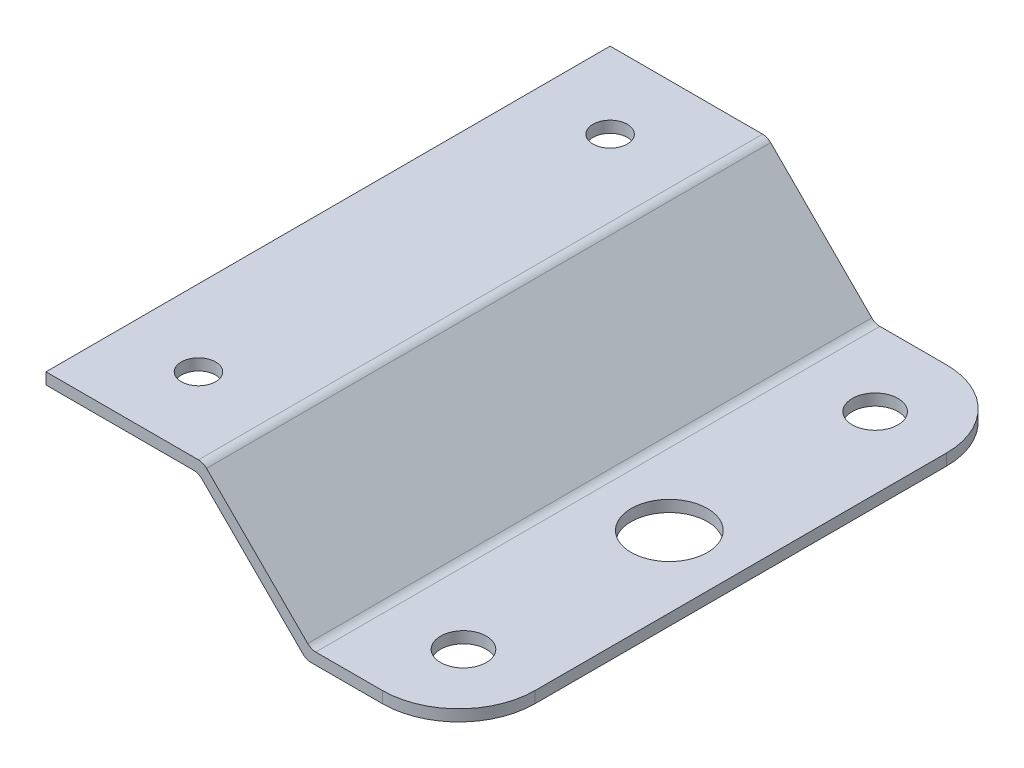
ISO-10303-21;
HEADER;
FILE_DESCRIPTION(('STEP AP214'),'2;1');
FILE_NAME('part.step','',(''),(''),'','','');
FILE_SCHEMA(('AUTOMOTIVE_DESIGN { 1 0 10303 214 1 1 1 1 }'));
ENDSEC;
DATA;
#1=APPLICATION_CONTEXT('core data for automotive mechanical design processes');
#2=APPLICATION_PROTOCOL_DEFINITION('international standard','automotive_design',2000,#1);
#3=PRODUCT_CONTEXT('',#1,'mechanical');
#4=PRODUCT('Part','Part','',(#3));
#5=PRODUCT_RELATED_PRODUCT_CATEGORY('part','',(#4));
#6=PRODUCT_DEFINITION_FORMATION('','',#4);
#7=PRODUCT_DEFINITION_CONTEXT('part definition',#1,'design');
#8=PRODUCT_DEFINITION('design','',#6,#7);
#9=PRODUCT_DEFINITION_SHAPE('','',#8);
#10=(LENGTH_UNIT() NAMED_UNIT(*) SI_UNIT(.MILLI.,.METRE.));
#11=(NAMED_UNIT(*) PLANE_ANGLE_UNIT() SI_UNIT($,.RADIAN.));
#12=(NAMED_UNIT(*) SI_UNIT($,.STERADIAN.) SOLID_ANGLE_UNIT());
#13=UNCERTAINTY_MEASURE_WITH_UNIT(LENGTH_MEASURE(1.E-05),#10,'distance_accuracy_value','');
#14=(GEOMETRIC_REPRESENTATION_CONTEXT(3) GLOBAL_UNCERTAINTY_ASSIGNED_CONTEXT((#13)) GLOBAL_UNIT_ASSIGNED_CONTEXT((#10,
#11,#12)) REPRESENTATION_CONTEXT('',''));
#15=CARTESIAN_POINT('',(0.,0.,0.));
#16=DIRECTION('',(0.,0.,1.));
#17=DIRECTION('',(1.,0.,0.));
#18=AXIS2_PLACEMENT_3D('',#15,#16,#17);
#19=CARTESIAN_POINT('',(0.,0.,74.));
#20=DIRECTION('',(1.,0.,0.));
#21=DIRECTION('',(0.,0.,-1.));
#22=AXIS2_PLACEMENT_3D('',#19,#20,#21);
#23=PLANE('',#22);
#24=DIRECTION('',(0.,-1.,0.));
#25=VECTOR('',#24,1.);
#26=CARTESIAN_POINT('',(0.,0.,0.));
#27=LINE('',#26,#25);
#28=CARTESIAN_POINT('',(0.,1.5,0.));
#29=VERTEX_POINT('',#28);
#30=CARTESIAN_POINT('',(0.,0.,0.));
#31=VERTEX_POINT('',#30);
#32=EDGE_CURVE('E138',#29,#31,#27,.T.);
#33=ORIENTED_EDGE('',*,*,#32,.T.);
#34=DIRECTION('',(0.,0.,-1.));
#35=VECTOR('',#34,1.);
#36=CARTESIAN_POINT('',(0.,0.,74.));
#37=LINE('',#36,#35);
#38=CARTESIAN_POINT('',(0.,0.,74.));
#39=VERTEX_POINT('',#38);
#40=EDGE_CURVE('E146',#39,#31,#37,.T.);
#41=ORIENTED_EDGE('',*,*,#40,.F.);
#42=DIRECTION('',(0.,-1.,0.));
#43=VECTOR('',#42,1.);
#44=CARTESIAN_POINT('',(0.,0.,74.));
#45=LINE('',#44,#43);
#46=CARTESIAN_POINT('',(0.,1.5,74.));
#47=VERTEX_POINT('',#46);
#48=EDGE_CURVE('E183',#47,#39,#45,.T.);
#49=ORIENTED_EDGE('',*,*,#48,.F.);
#50=DIRECTION('',(0.,0.,-1.));
#51=VECTOR('',#50,1.);
#52=CARTESIAN_POINT('',(0.,1.5,74.));
#53=LINE('',#52,#51);
#54=EDGE_CURVE('E157',#47,#29,#53,.T.);
#55=ORIENTED_EDGE('',*,*,#54,.T.);
#56=EDGE_LOOP('',(#33,#41,#49,#55));
#57=FACE_BOUND('',#56,.T.);
#58=ADVANCED_FACE('F34',(#57),#23,.F.);
#59=CARTESIAN_POINT('',(0.,0.,74.));
#60=DIRECTION('',(0.,1.,0.));
#61=DIRECTION('',(0.,0.,1.));
#62=AXIS2_PLACEMENT_3D('',#59,#60,#61);
#63=PLANE('',#62);
#64=CARTESIAN_POINT('',(10.,0.,64.));
#65=DIRECTION('',(0.,1.,0.));
#66=DIRECTION('',(0.,0.,1.));
#67=AXIS2_PLACEMENT_3D('',#64,#65,#66);
#68=CIRCLE('',#67,2.25);
#69=CARTESIAN_POINT('',(10.,0.,66.25));
#70=VERTEX_POINT('',#69);
#71=EDGE_CURVE('E379',#70,#70,#68,.T.);
#72=ORIENTED_EDGE('',*,*,#71,.T.);
#73=EDGE_LOOP('',(#72));
#74=FACE_BOUND('',#73,.T.);
#75=CARTESIAN_POINT('',(10.,0.,10.));
#76=DIRECTION('',(0.,1.,0.));
#77=DIRECTION('',(0.,0.,1.));
#78=AXIS2_PLACEMENT_3D('',#75,#76,#77);
#79=CIRCLE('',#78,2.25);
#80=CARTESIAN_POINT('',(10.,0.,12.25));
#81=VERTEX_POINT('',#80);
#82=EDGE_CURVE('E158',#81,#81,#79,.T.);
#83=ORIENTED_EDGE('',*,*,#82,.T.);
#84=EDGE_LOOP('',(#83));
#85=FACE_BOUND('',#84,.T.);
#86=DIRECTION('',(1.,0.,0.));
#87=VECTOR('',#86,1.);
#88=CARTESIAN_POINT('',(0.,0.,0.));
#89=LINE('',#88,#87);
#90=CARTESIAN_POINT('',(19.3786796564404,0.,0.));
#91=VERTEX_POINT('',#90);
#92=EDGE_CURVE('E132',#31,#91,#89,.T.);
#93=ORIENTED_EDGE('',*,*,#92,.T.);
#94=DIRECTION('',(0.,0.,-1.));
#95=VECTOR('',#94,1.);
#96=CARTESIAN_POINT('',(19.3786796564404,0.,74.));
#97=LINE('',#96,#95);
#98=CARTESIAN_POINT('',(19.3786796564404,0.,74.));
#99=VERTEX_POINT('',#98);
#100=EDGE_CURVE('E153',#99,#91,#97,.T.);
#101=ORIENTED_EDGE('',*,*,#100,.F.);
#102=DIRECTION('',(1.,0.,0.));
#103=VECTOR('',#102,1.);
#104=CARTESIAN_POINT('',(0.,0.,74.));
#105=LINE('',#104,#103);
#106=EDGE_CURVE('E148',#39,#99,#105,.T.);
#107=ORIENTED_EDGE('',*,*,#106,.F.);
#108=ORIENTED_EDGE('',*,*,#40,.T.);
#109=EDGE_LOOP('',(#93,#101,#107,#108));
#110=FACE_BOUND('',#109,.T.);
#111=ADVANCED_FACE('F147',(#74,#85,#110),#63,.F.);
#112=CARTESIAN_POINT('',(19.3786796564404,-1.5,74.));
#113=DIRECTION('',(0.,0.,-1.));
#114=DIRECTION('',(-1.,0.,0.));
#115=AXIS2_PLACEMENT_3D('',#112,#113,#114);
#116=CYLINDRICAL_SURFACE('',#115,1.5);
#117=CARTESIAN_POINT('',(19.3786796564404,-1.5,0.));
#118=DIRECTION('',(0.,0.,-1.));
#119=DIRECTION('',(1.,0.,0.));
#120=AXIS2_PLACEMENT_3D('',#117,#118,#119);
#121=CIRCLE('',#120,1.5);
#122=CARTESIAN_POINT('',(20.4393398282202,-0.439339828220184,0.));
#123=VERTEX_POINT('',#122);
#124=EDGE_CURVE('E140',#91,#123,#121,.T.);
#125=ORIENTED_EDGE('',*,*,#124,.T.);
#126=DIRECTION('',(0.,0.,-1.));
#127=VECTOR('',#126,1.);
#128=CARTESIAN_POINT('',(20.4393398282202,-0.439339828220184,74.));
#129=LINE('',#128,#127);
#130=CARTESIAN_POINT('',(20.4393398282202,-0.439339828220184,74.));
#131=VERTEX_POINT('',#130);
#132=EDGE_CURVE('E228',#131,#123,#129,.T.);
#133=ORIENTED_EDGE('',*,*,#132,.F.);
#134=CARTESIAN_POINT('',(19.3786796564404,-1.5,74.));
#135=DIRECTION('',(0.,0.,-1.));
#136=DIRECTION('',(1.,0.,0.));
#137=AXIS2_PLACEMENT_3D('',#134,#135,#136);
#138=CIRCLE('',#137,1.5);
#139=EDGE_CURVE('E186',#99,#131,#138,.T.);
#140=ORIENTED_EDGE('',*,*,#139,.F.);
#141=ORIENTED_EDGE('',*,*,#100,.T.);
#142=EDGE_LOOP('',(#125,#133,#140,#141));
#143=FACE_BOUND('',#142,.T.);
#144=ADVANCED_FACE('F273',(#143),#116,.F.);
#145=CARTESIAN_POINT('',(20.4393398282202,-0.439339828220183,74.));
#146=DIRECTION('',(0.707106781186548,0.707106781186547,0.));
#147=DIRECTION('',(-0.707106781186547,0.707106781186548,0.));
#148=AXIS2_PLACEMENT_3D('',#145,#146,#147);
#149=PLANE('',#148);
#150=DIRECTION('',(0.707106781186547,-0.707106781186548,0.));
#151=VECTOR('',#150,1.);
#152=CARTESIAN_POINT('',(20.4393398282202,-0.439339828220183,0.));
#153=LINE('',#152,#151);
#154=CARTESIAN_POINT('',(33.7027957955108,-13.7027957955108,0.));
#155=VERTEX_POINT('',#154);
#156=EDGE_CURVE('E166',#123,#155,#153,.T.);
#157=ORIENTED_EDGE('',*,*,#156,.T.);
#158=DIRECTION('',(0.,0.,-1.));
#159=VECTOR('',#158,1.);
#160=CARTESIAN_POINT('',(33.7027957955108,-13.7027957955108,74.));
#161=LINE('',#160,#159);
#162=CARTESIAN_POINT('',(33.7027957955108,-13.7027957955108,74.));
#163=VERTEX_POINT('',#162);
#164=EDGE_CURVE('E225',#163,#155,#161,.T.);
#165=ORIENTED_EDGE('',*,*,#164,.F.);
#166=DIRECTION('',(0.707106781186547,-0.707106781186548,0.));
#167=VECTOR('',#166,1.);
#168=CARTESIAN_POINT('',(20.4393398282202,-0.439339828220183,74.));
#169=LINE('',#168,#167);
#170=EDGE_CURVE('E188',#131,#163,#169,.T.);
#171=ORIENTED_EDGE('',*,*,#170,.F.);
#172=ORIENTED_EDGE('',*,*,#132,.T.);
#173=EDGE_LOOP('',(#157,#165,#171,#172));
#174=FACE_BOUND('',#173,.T.);
#175=ADVANCED_FACE('F277',(#174),#149,.F.);
#176=CARTESIAN_POINT('',(34.7634559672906,-12.6421356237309,74.));
#177=DIRECTION('',(0.,0.,-1.));
#178=DIRECTION('',(-1.,0.,0.));
#179=AXIS2_PLACEMENT_3D('',#176,#177,#178);
#180=CYLINDRICAL_SURFACE('',#179,1.5);
#181=CARTESIAN_POINT('',(34.7634559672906,-12.6421356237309,0.));
#182=DIRECTION('',(0.,0.,1.));
#183=DIRECTION('',(1.,0.,0.));
#184=AXIS2_PLACEMENT_3D('',#181,#182,#183);
#185=CIRCLE('',#184,1.5);
#186=CARTESIAN_POINT('',(34.7634559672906,-14.1421356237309,0.));
#187=VERTEX_POINT('',#186);
#188=EDGE_CURVE('E168',#155,#187,#185,.T.);
#189=ORIENTED_EDGE('',*,*,#188,.T.);
#190=DIRECTION('',(0.,0.,-1.));
#191=VECTOR('',#190,1.);
#192=CARTESIAN_POINT('',(34.7634559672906,-14.1421356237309,74.));
#193=LINE('',#192,#191);
#194=CARTESIAN_POINT('',(34.7634559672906,-14.1421356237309,74.));
#195=VERTEX_POINT('',#194);
#196=EDGE_CURVE('E222',#195,#187,#193,.T.);
#197=ORIENTED_EDGE('',*,*,#196,.F.);
#198=CARTESIAN_POINT('',(34.7634559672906,-12.6421356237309,74.));
#199=DIRECTION('',(0.,0.,1.));
#200=DIRECTION('',(1.,0.,0.));
#201=AXIS2_PLACEMENT_3D('',#198,#199,#200);
#202=CIRCLE('',#201,1.5);
#203=EDGE_CURVE('E190',#163,#195,#202,.T.);
#204=ORIENTED_EDGE('',*,*,#203,.F.);
#205=ORIENTED_EDGE('',*,*,#164,.T.);
#206=EDGE_LOOP('',(#189,#197,#204,#205));
#207=FACE_BOUND('',#206,.T.);
#208=ADVANCED_FACE('F281',(#207),#180,.T.);
#209=CARTESIAN_POINT('',(34.7634559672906,-14.1421356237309,74.));
#210=DIRECTION('',(0.,1.,0.));
#211=DIRECTION('',(-1.,0.,0.));
#212=AXIS2_PLACEMENT_3D('',#209,#210,#211);
#213=PLANE('',#212);
#214=CARTESIAN_POINT('',(44.7634559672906,-14.1421356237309,64.));
#215=DIRECTION('',(0.,1.,0.));
#216=DIRECTION('',(-1.,0.,0.));
#217=AXIS2_PLACEMENT_3D('',#214,#215,#216);
#218=CIRCLE('',#217,3.);
#219=CARTESIAN_POINT('',(41.7634559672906,-14.1421356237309,64.));
#220=VERTEX_POINT('',#219);
#221=EDGE_CURVE('E360',#220,#220,#218,.T.);
#222=ORIENTED_EDGE('',*,*,#221,.T.);
#223=EDGE_LOOP('',(#222));
#224=FACE_BOUND('',#223,.T.);
#225=CARTESIAN_POINT('',(44.7634559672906,-14.1421356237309,37.));
#226=DIRECTION('',(0.,1.,0.));
#227=DIRECTION('',(-1.,0.,0.));
#228=AXIS2_PLACEMENT_3D('',#225,#226,#227);
#229=CIRCLE('',#228,5.);
#230=CARTESIAN_POINT('',(39.7634559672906,-14.1421356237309,37.));
#231=VERTEX_POINT('',#230);
#232=EDGE_CURVE('E364',#231,#231,#229,.T.);
#233=ORIENTED_EDGE('',*,*,#232,.T.);
#234=EDGE_LOOP('',(#233));
#235=FACE_BOUND('',#234,.T.);
#236=CARTESIAN_POINT('',(44.7634559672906,-14.1421356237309,9.99999999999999));
#237=DIRECTION('',(0.,1.,0.));
#238=DIRECTION('',(-1.,0.,0.));
#239=AXIS2_PLACEMENT_3D('',#236,#237,#238);
#240=CIRCLE('',#239,3.);
#241=CARTESIAN_POINT('',(41.7634559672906,-14.1421356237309,9.99999999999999));
#242=VERTEX_POINT('',#241);
#243=EDGE_CURVE('E373',#242,#242,#240,.T.);
#244=ORIENTED_EDGE('',*,*,#243,.T.);
#245=EDGE_LOOP('',(#244));
#246=FACE_BOUND('',#245,.T.);
#247=DIRECTION('',(0.,0.,-1.));
#248=VECTOR('',#247,1.);
#249=CARTESIAN_POINT('',(54.142135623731,-14.1421356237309,74.));
#250=LINE('',#249,#248);
#251=CARTESIAN_POINT('',(54.142135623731,-14.1421356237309,64.));
#252=VERTEX_POINT('',#251);
#253=CARTESIAN_POINT('',(54.142135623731,-14.1421356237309,9.99999999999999));
#254=VERTEX_POINT('',#253);
#255=EDGE_CURVE('E220',#252,#254,#250,.T.);
#256=ORIENTED_EDGE('',*,*,#255,.F.);
#257=CARTESIAN_POINT('',(44.142135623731,-14.1421356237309,64.));
#258=DIRECTION('',(0.,1.,0.));
#259=DIRECTION('',(-1.,0.,0.));
#260=AXIS2_PLACEMENT_3D('',#257,#258,#259);
#261=CIRCLE('',#260,10.);
#262=CARTESIAN_POINT('',(44.1421356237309,-14.1421356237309,74.));
#263=VERTEX_POINT('',#262);
#264=EDGE_CURVE('E11',#252,#263,#261,.F.);
#265=ORIENTED_EDGE('',*,*,#264,.T.);
#266=DIRECTION('',(1.,0.,0.));
#267=VECTOR('',#266,1.);
#268=CARTESIAN_POINT('',(34.7634559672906,-14.1421356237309,74.));
#269=LINE('',#268,#267);
#270=EDGE_CURVE('E192',#195,#263,#269,.T.);
#271=ORIENTED_EDGE('',*,*,#270,.F.);
#272=ORIENTED_EDGE('',*,*,#196,.T.);
#273=DIRECTION('',(1.,0.,0.));
#274=VECTOR('',#273,1.);
#275=CARTESIAN_POINT('',(34.7634559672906,-14.1421356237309,0.));
#276=LINE('',#275,#274);
#277=CARTESIAN_POINT('',(44.1421356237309,-14.1421356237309,0.));
#278=VERTEX_POINT('',#277);
#279=EDGE_CURVE('E170',#187,#278,#276,.T.);
#280=ORIENTED_EDGE('',*,*,#279,.T.);
#281=CARTESIAN_POINT('',(44.142135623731,-14.1421356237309,9.99999999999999));
#282=DIRECTION('',(0.,1.,0.));
#283=DIRECTION('',(-1.,0.,0.));
#284=AXIS2_PLACEMENT_3D('',#281,#282,#283);
#285=CIRCLE('',#284,10.);
#286=EDGE_CURVE('E238',#278,#254,#285,.F.);
#287=ORIENTED_EDGE('',*,*,#286,.T.);
#288=EDGE_LOOP('',(#256,#265,#271,#272,#280,#287));
#289=FACE_BOUND('',#288,.T.);
#290=ADVANCED_FACE('F285',(#224,#235,#246,#289),#213,.F.);
#291=CARTESIAN_POINT('',(54.142135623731,-14.1421356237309,74.));
#292=DIRECTION('',(-1.,0.,0.));
#293=DIRECTION('',(0.,0.,1.));
#294=AXIS2_PLACEMENT_3D('',#291,#292,#293);
#295=PLANE('',#294);
#296=DIRECTION('',(0.,0.,-1.));
#297=VECTOR('',#296,1.);
#298=CARTESIAN_POINT('',(54.142135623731,-12.6421356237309,74.));
#299=LINE('',#298,#297);
#300=CARTESIAN_POINT('',(54.142135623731,-12.6421356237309,64.));
#301=VERTEX_POINT('',#300);
#302=CARTESIAN_POINT('',(54.142135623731,-12.6421356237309,9.99999999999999));
#303=VERTEX_POINT('',#302);
#304=EDGE_CURVE('E218',#301,#303,#299,.T.);
#305=ORIENTED_EDGE('',*,*,#304,.F.);
#306=DIRECTION('',(0.,1.,0.));
#307=VECTOR('',#306,1.);
#308=CARTESIAN_POINT('',(54.142135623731,-14.1421356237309,64.));
#309=LINE('',#308,#307);
#310=EDGE_CURVE('E41',#301,#252,#309,.F.);
#311=ORIENTED_EDGE('',*,*,#310,.T.);
#312=ORIENTED_EDGE('',*,*,#255,.T.);
#313=DIRECTION('',(0.,1.,0.));
#314=VECTOR('',#313,1.);
#315=CARTESIAN_POINT('',(54.142135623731,-14.1421356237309,9.99999999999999));
#316=LINE('',#315,#314);
#317=EDGE_CURVE('E152',#254,#303,#316,.T.);
#318=ORIENTED_EDGE('',*,*,#317,.T.);
#319=EDGE_LOOP('',(#305,#311,#312,#318));
#320=FACE_BOUND('',#319,.T.);
#321=ADVANCED_FACE('F314',(#320),#295,.F.);
#322=CARTESIAN_POINT('',(54.142135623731,-12.6421356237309,74.));
#323=DIRECTION('',(0.,-1.,0.));
#324=DIRECTION('',(1.,0.,0.));
#325=AXIS2_PLACEMENT_3D('',#322,#323,#324);
#326=PLANE('',#325);
#327=CARTESIAN_POINT('',(44.7634559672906,-12.6421356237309,64.));
#328=DIRECTION('',(0.,1.,0.));
#329=DIRECTION('',(-1.,0.,0.));
#330=AXIS2_PLACEMENT_3D('',#327,#328,#329);
#331=CIRCLE('',#330,3.);
#332=CARTESIAN_POINT('',(41.7634559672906,-12.6421356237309,64.));
#333=VERTEX_POINT('',#332);
#334=EDGE_CURVE('E357',#333,#333,#331,.T.);
#335=ORIENTED_EDGE('',*,*,#334,.F.);
#336=EDGE_LOOP('',(#335));
#337=FACE_BOUND('',#336,.T.);
#338=CARTESIAN_POINT('',(44.7634559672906,-12.6421356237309,37.));
#339=DIRECTION('',(0.,1.,0.));
#340=DIRECTION('',(-1.,0.,0.));
#341=AXIS2_PLACEMENT_3D('',#338,#339,#340);
#342=CIRCLE('',#341,5.);
#343=CARTESIAN_POINT('',(39.7634559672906,-12.6421356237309,37.));
#344=VERTEX_POINT('',#343);
#345=EDGE_CURVE('E361',#344,#344,#342,.T.);
#346=ORIENTED_EDGE('',*,*,#345,.F.);
#347=EDGE_LOOP('',(#346));
#348=FACE_BOUND('',#347,.T.);
#349=CARTESIAN_POINT('',(44.7634559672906,-12.6421356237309,9.99999999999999));
#350=DIRECTION('',(0.,1.,0.));
#351=DIRECTION('',(-1.,0.,0.));
#352=AXIS2_PLACEMENT_3D('',#349,#350,#351);
#353=CIRCLE('',#352,3.);
#354=CARTESIAN_POINT('',(41.7634559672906,-12.6421356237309,9.99999999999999));
#355=VERTEX_POINT('',#354);
#356=EDGE_CURVE('E370',#355,#355,#353,.T.);
#357=ORIENTED_EDGE('',*,*,#356,.F.);
#358=EDGE_LOOP('',(#357));
#359=FACE_BOUND('',#358,.T.);
#360=DIRECTION('',(-1.,0.,0.));
#361=VECTOR('',#360,1.);
#362=CARTESIAN_POINT('',(54.142135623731,-12.6421356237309,74.));
#363=LINE('',#362,#361);
#364=CARTESIAN_POINT('',(44.142135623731,-12.6421356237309,74.));
#365=VERTEX_POINT('',#364);
#366=CARTESIAN_POINT('',(35.3847763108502,-12.6421356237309,74.));
#367=VERTEX_POINT('',#366);
#368=EDGE_CURVE('E195',#365,#367,#363,.T.);
#369=ORIENTED_EDGE('',*,*,#368,.F.);
#370=CARTESIAN_POINT('',(44.142135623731,-12.6421356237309,64.));
#371=DIRECTION('',(0.,-1.,0.));
#372=DIRECTION('',(1.,0.,0.));
#373=AXIS2_PLACEMENT_3D('',#370,#371,#372);
#374=CIRCLE('',#373,10.);
#375=EDGE_CURVE('E55',#365,#301,#374,.F.);
#376=ORIENTED_EDGE('',*,*,#375,.T.);
#377=ORIENTED_EDGE('',*,*,#304,.T.);
#378=CARTESIAN_POINT('',(44.142135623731,-12.6421356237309,9.99999999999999));
#379=DIRECTION('',(0.,-1.,0.));
#380=DIRECTION('',(1.,0.,0.));
#381=AXIS2_PLACEMENT_3D('',#378,#379,#380);
#382=CIRCLE('',#381,10.);
#383=CARTESIAN_POINT('',(44.142135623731,-12.6421356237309,0.));
#384=VERTEX_POINT('',#383);
#385=EDGE_CURVE('E234',#303,#384,#382,.F.);
#386=ORIENTED_EDGE('',*,*,#385,.T.);
#387=DIRECTION('',(-1.,0.,0.));
#388=VECTOR('',#387,1.);
#389=CARTESIAN_POINT('',(54.142135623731,-12.6421356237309,0.));
#390=LINE('',#389,#388);
#391=CARTESIAN_POINT('',(35.3847763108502,-12.6421356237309,0.));
#392=VERTEX_POINT('',#391);
#393=EDGE_CURVE('E173',#384,#392,#390,.T.);
#394=ORIENTED_EDGE('',*,*,#393,.T.);
#395=DIRECTION('',(0.,0.,-1.));
#396=VECTOR('',#395,1.);
#397=CARTESIAN_POINT('',(35.3847763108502,-12.6421356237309,74.));
#398=LINE('',#397,#396);
#399=EDGE_CURVE('E215',#367,#392,#398,.T.);
#400=ORIENTED_EDGE('',*,*,#399,.F.);
#401=EDGE_LOOP('',(#369,#376,#377,#386,#394,#400));
#402=FACE_BOUND('',#401,.T.);
#403=ADVANCED_FACE('F251',(#337,#348,#359,#402),#326,.F.);
#404=CARTESIAN_POINT('',(35.3847763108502,-11.1421356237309,74.));
#405=DIRECTION('',(0.,0.,-1.));
#406=DIRECTION('',(-1.,0.,0.));
#407=AXIS2_PLACEMENT_3D('',#404,#405,#406);
#408=CYLINDRICAL_SURFACE('',#407,1.5);
#409=CARTESIAN_POINT('',(35.3847763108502,-11.1421356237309,0.));
#410=DIRECTION('',(0.,0.,-1.));
#411=DIRECTION('',(1.,0.,0.));
#412=AXIS2_PLACEMENT_3D('',#409,#410,#411);
#413=CIRCLE('',#412,1.5);
#414=CARTESIAN_POINT('',(34.3241161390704,-12.2027957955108,0.));
#415=VERTEX_POINT('',#414);
#416=EDGE_CURVE('E175',#392,#415,#413,.T.);
#417=ORIENTED_EDGE('',*,*,#416,.T.);
#418=DIRECTION('',(0.,0.,-1.));
#419=VECTOR('',#418,1.);
#420=CARTESIAN_POINT('',(34.3241161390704,-12.2027957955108,74.));
#421=LINE('',#420,#419);
#422=CARTESIAN_POINT('',(34.3241161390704,-12.2027957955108,74.));
#423=VERTEX_POINT('',#422);
#424=EDGE_CURVE('E212',#423,#415,#421,.T.);
#425=ORIENTED_EDGE('',*,*,#424,.F.);
#426=CARTESIAN_POINT('',(35.3847763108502,-11.1421356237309,74.));
#427=DIRECTION('',(0.,0.,-1.));
#428=DIRECTION('',(1.,0.,0.));
#429=AXIS2_PLACEMENT_3D('',#426,#427,#428);
#430=CIRCLE('',#429,1.5);
#431=EDGE_CURVE('E197',#367,#423,#430,.T.);
#432=ORIENTED_EDGE('',*,*,#431,.F.);
#433=ORIENTED_EDGE('',*,*,#399,.T.);
#434=EDGE_LOOP('',(#417,#425,#432,#433));
#435=FACE_BOUND('',#434,.T.);
#436=ADVANCED_FACE('F256',(#435),#408,.F.);
#437=CARTESIAN_POINT('',(21.0606601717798,1.06066017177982,74.));
#438=DIRECTION('',(-0.707106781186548,-0.707106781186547,0.));
#439=DIRECTION('',(0.707106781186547,-0.707106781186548,0.));
#440=AXIS2_PLACEMENT_3D('',#437,#438,#439);
#441=PLANE('',#440);
#442=DIRECTION('',(-0.707106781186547,0.707106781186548,0.));
#443=VECTOR('',#442,1.);
#444=CARTESIAN_POINT('',(21.0606601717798,1.06066017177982,0.));
#445=LINE('',#444,#443);
#446=CARTESIAN_POINT('',(21.0606601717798,1.06066017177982,0.));
#447=VERTEX_POINT('',#446);
#448=EDGE_CURVE('E177',#415,#447,#445,.T.);
#449=ORIENTED_EDGE('',*,*,#448,.T.);
#450=DIRECTION('',(0.,0.,-1.));
#451=VECTOR('',#450,1.);
#452=CARTESIAN_POINT('',(21.0606601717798,1.06066017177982,74.));
#453=LINE('',#452,#451);
#454=CARTESIAN_POINT('',(21.0606601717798,1.06066017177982,74.));
#455=VERTEX_POINT('',#454);
#456=EDGE_CURVE('E209',#455,#447,#453,.T.);
#457=ORIENTED_EDGE('',*,*,#456,.F.);
#458=DIRECTION('',(-0.707106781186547,0.707106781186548,0.));
#459=VECTOR('',#458,1.);
#460=CARTESIAN_POINT('',(21.0606601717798,1.06066017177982,74.));
#461=LINE('',#460,#459);
#462=EDGE_CURVE('E199',#423,#455,#461,.T.);
#463=ORIENTED_EDGE('',*,*,#462,.F.);
#464=ORIENTED_EDGE('',*,*,#424,.T.);
#465=EDGE_LOOP('',(#449,#457,#463,#464));
#466=FACE_BOUND('',#465,.T.);
#467=ADVANCED_FACE('F262',(#466),#441,.F.);
#468=CARTESIAN_POINT('',(20.,0.,74.));
#469=DIRECTION('',(0.,0.,-1.));
#470=DIRECTION('',(-1.,0.,0.));
#471=AXIS2_PLACEMENT_3D('',#468,#469,#470);
#472=CYLINDRICAL_SURFACE('',#471,1.5);
#473=CARTESIAN_POINT('',(20.,0.,0.));
#474=DIRECTION('',(0.,0.,1.));
#475=DIRECTION('',(1.,0.,0.));
#476=AXIS2_PLACEMENT_3D('',#473,#474,#475);
#477=CIRCLE('',#476,1.5);
#478=CARTESIAN_POINT('',(20.,1.5,0.));
#479=VERTEX_POINT('',#478);
#480=EDGE_CURVE('E179',#447,#479,#477,.T.);
#481=ORIENTED_EDGE('',*,*,#480,.T.);
#482=DIRECTION('',(0.,0.,-1.));
#483=VECTOR('',#482,1.);
#484=CARTESIAN_POINT('',(20.,1.5,74.));
#485=LINE('',#484,#483);
#486=CARTESIAN_POINT('',(20.,1.5,74.));
#487=VERTEX_POINT('',#486);
#488=EDGE_CURVE('E206',#487,#479,#485,.T.);
#489=ORIENTED_EDGE('',*,*,#488,.F.);
#490=CARTESIAN_POINT('',(20.,0.,74.));
#491=DIRECTION('',(0.,0.,1.));
#492=DIRECTION('',(1.,0.,0.));
#493=AXIS2_PLACEMENT_3D('',#490,#491,#492);
#494=CIRCLE('',#493,1.5);
#495=EDGE_CURVE('E201',#455,#487,#494,.T.);
#496=ORIENTED_EDGE('',*,*,#495,.F.);
#497=ORIENTED_EDGE('',*,*,#456,.T.);
#498=EDGE_LOOP('',(#481,#489,#496,#497));
#499=FACE_BOUND('',#498,.T.);
#500=ADVANCED_FACE('F266',(#499),#472,.T.);
#501=CARTESIAN_POINT('',(0.,1.5,74.));
#502=DIRECTION('',(0.,-1.,0.));
#503=DIRECTION('',(1.,0.,0.));
#504=AXIS2_PLACEMENT_3D('',#501,#502,#503);
#505=PLANE('',#504);
#506=CARTESIAN_POINT('',(10.,1.5,64.));
#507=DIRECTION('',(0.,1.,0.));
#508=DIRECTION('',(-1.,0.,0.));
#509=AXIS2_PLACEMENT_3D('',#506,#507,#508);
#510=CIRCLE('',#509,2.25);
#511=CARTESIAN_POINT('',(7.75,1.5,64.));
#512=VERTEX_POINT('',#511);
#513=EDGE_CURVE('E376',#512,#512,#510,.T.);
#514=ORIENTED_EDGE('',*,*,#513,.F.);
#515=EDGE_LOOP('',(#514));
#516=FACE_BOUND('',#515,.T.);
#517=CARTESIAN_POINT('',(10.,1.5,10.));
#518=DIRECTION('',(0.,1.,0.));
#519=DIRECTION('',(-1.,0.,0.));
#520=AXIS2_PLACEMENT_3D('',#517,#518,#519);
#521=CIRCLE('',#520,2.25);
#522=CARTESIAN_POINT('',(7.75,1.5,10.));
#523=VERTEX_POINT('',#522);
#524=EDGE_CURVE('E161',#523,#523,#521,.T.);
#525=ORIENTED_EDGE('',*,*,#524,.F.);
#526=EDGE_LOOP('',(#525));
#527=FACE_BOUND('',#526,.T.);
#528=DIRECTION('',(-1.,0.,0.));
#529=VECTOR('',#528,1.);
#530=CARTESIAN_POINT('',(0.,1.5,0.));
#531=LINE('',#530,#529);
#532=EDGE_CURVE('E181',#479,#29,#531,.T.);
#533=ORIENTED_EDGE('',*,*,#532,.T.);
#534=ORIENTED_EDGE('',*,*,#54,.F.);
#535=DIRECTION('',(-1.,0.,0.));
#536=VECTOR('',#535,1.);
#537=CARTESIAN_POINT('',(0.,1.5,74.));
#538=LINE('',#537,#536);
#539=EDGE_CURVE('E203',#487,#47,#538,.T.);
#540=ORIENTED_EDGE('',*,*,#539,.F.);
#541=ORIENTED_EDGE('',*,*,#488,.T.);
#542=EDGE_LOOP('',(#533,#534,#540,#541));
#543=FACE_BOUND('',#542,.T.);
#544=ADVANCED_FACE('F269',(#516,#527,#543),#505,.F.);
#545=CARTESIAN_POINT('',(20.,0.,74.));
#546=DIRECTION('',(0.,0.,1.));
#547=DIRECTION('',(1.,0.,0.));
#548=AXIS2_PLACEMENT_3D('',#545,#546,#547);
#549=PLANE('',#548);
#550=ORIENTED_EDGE('',*,*,#270,.T.);
#551=DIRECTION('',(0.,1.,0.));
#552=VECTOR('',#551,1.);
#553=CARTESIAN_POINT('',(44.142135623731,-12.6421356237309,74.));
#554=LINE('',#553,#552);
#555=EDGE_CURVE('E241',#263,#365,#554,.T.);
#556=ORIENTED_EDGE('',*,*,#555,.T.);
#557=ORIENTED_EDGE('',*,*,#368,.T.);
#558=ORIENTED_EDGE('',*,*,#431,.T.);
#559=ORIENTED_EDGE('',*,*,#462,.T.);
#560=ORIENTED_EDGE('',*,*,#495,.T.);
#561=ORIENTED_EDGE('',*,*,#539,.T.);
#562=ORIENTED_EDGE('',*,*,#48,.T.);
#563=ORIENTED_EDGE('',*,*,#106,.T.);
#564=ORIENTED_EDGE('',*,*,#139,.T.);
#565=ORIENTED_EDGE('',*,*,#170,.T.);
#566=ORIENTED_EDGE('',*,*,#203,.T.);
#567=EDGE_LOOP('',(#550,#556,#557,#558,#559,#560,#561,#562,#563,#564,#565,#566));
#568=FACE_BOUND('',#567,.T.);
#569=ADVANCED_FACE('F246',(#568),#549,.T.);
#570=CARTESIAN_POINT('',(20.,0.,0.));
#571=DIRECTION('',(0.,0.,1.));
#572=DIRECTION('',(1.,0.,0.));
#573=AXIS2_PLACEMENT_3D('',#570,#571,#572);
#574=PLANE('',#573);
#575=ORIENTED_EDGE('',*,*,#393,.F.);
#576=DIRECTION('',(0.,1.,0.));
#577=VECTOR('',#576,1.);
#578=CARTESIAN_POINT('',(44.142135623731,0.,0.));
#579=LINE('',#578,#577);
#580=EDGE_CURVE('E236',#384,#278,#579,.F.);
#581=ORIENTED_EDGE('',*,*,#580,.T.);
#582=ORIENTED_EDGE('',*,*,#279,.F.);
#583=ORIENTED_EDGE('',*,*,#188,.F.);
#584=ORIENTED_EDGE('',*,*,#156,.F.);
#585=ORIENTED_EDGE('',*,*,#124,.F.);
#586=ORIENTED_EDGE('',*,*,#92,.F.);
#587=ORIENTED_EDGE('',*,*,#32,.F.);
#588=ORIENTED_EDGE('',*,*,#532,.F.);
#589=ORIENTED_EDGE('',*,*,#480,.F.);
#590=ORIENTED_EDGE('',*,*,#448,.F.);
#591=ORIENTED_EDGE('',*,*,#416,.F.);
#592=EDGE_LOOP('',(#575,#581,#582,#583,#584,#585,#586,#587,#588,#589,#590,#591));
#593=FACE_BOUND('',#592,.T.);
#594=ADVANCED_FACE('F135',(#593),#574,.F.);
#595=CARTESIAN_POINT('',(10.,-72.5,10.));
#596=DIRECTION('',(0.,1.,0.));
#597=DIRECTION('',(-1.,0.,0.));
#598=AXIS2_PLACEMENT_3D('',#595,#596,#597);
#599=CYLINDRICAL_SURFACE('',#598,2.25);
#600=ORIENTED_EDGE('',*,*,#524,.T.);
#601=EDGE_LOOP('',(#600));
#602=FACE_BOUND('',#601,.T.);
#603=ORIENTED_EDGE('',*,*,#82,.F.);
#604=EDGE_LOOP('',(#603));
#605=FACE_BOUND('',#604,.T.);
#606=ADVANCED_FACE('F334',(#602,#605),#599,.F.);
#607=CARTESIAN_POINT('',(10.,-72.5,64.));
#608=DIRECTION('',(0.,1.,0.));
#609=DIRECTION('',(-1.,0.,0.));
#610=AXIS2_PLACEMENT_3D('',#607,#608,#609);
#611=CYLINDRICAL_SURFACE('',#610,2.25);
#612=ORIENTED_EDGE('',*,*,#513,.T.);
#613=EDGE_LOOP('',(#612));
#614=FACE_BOUND('',#613,.T.);
#615=ORIENTED_EDGE('',*,*,#71,.F.);
#616=EDGE_LOOP('',(#615));
#617=FACE_BOUND('',#616,.T.);
#618=ADVANCED_FACE('F337',(#614,#617),#611,.F.);
#619=CARTESIAN_POINT('',(44.7634559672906,-86.6421356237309,9.99999999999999));
#620=DIRECTION('',(0.,1.,0.));
#621=DIRECTION('',(-1.,0.,0.));
#622=AXIS2_PLACEMENT_3D('',#619,#620,#621);
#623=CYLINDRICAL_SURFACE('',#622,3.);
#624=ORIENTED_EDGE('',*,*,#356,.T.);
#625=EDGE_LOOP('',(#624));
#626=FACE_BOUND('',#625,.T.);
#627=ORIENTED_EDGE('',*,*,#243,.F.);
#628=EDGE_LOOP('',(#627));
#629=FACE_BOUND('',#628,.T.);
#630=ADVANCED_FACE('F341',(#626,#629),#623,.F.);
#631=CARTESIAN_POINT('',(44.7634559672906,-86.6421356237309,37.));
#632=DIRECTION('',(0.,1.,0.));
#633=DIRECTION('',(-1.,0.,0.));
#634=AXIS2_PLACEMENT_3D('',#631,#632,#633);
#635=CYLINDRICAL_SURFACE('',#634,5.);
#636=ORIENTED_EDGE('',*,*,#345,.T.);
#637=EDGE_LOOP('',(#636));
#638=FACE_BOUND('',#637,.T.);
#639=ORIENTED_EDGE('',*,*,#232,.F.);
#640=EDGE_LOOP('',(#639));
#641=FACE_BOUND('',#640,.T.);
#642=ADVANCED_FACE('F345',(#638,#641),#635,.F.);
#643=CARTESIAN_POINT('',(44.7634559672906,-86.6421356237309,64.));
#644=DIRECTION('',(0.,1.,0.));
#645=DIRECTION('',(-1.,0.,0.));
#646=AXIS2_PLACEMENT_3D('',#643,#644,#645);
#647=CYLINDRICAL_SURFACE('',#646,3.);
#648=ORIENTED_EDGE('',*,*,#334,.T.);
#649=EDGE_LOOP('',(#648));
#650=FACE_BOUND('',#649,.T.);
#651=ORIENTED_EDGE('',*,*,#221,.F.);
#652=EDGE_LOOP('',(#651));
#653=FACE_BOUND('',#652,.T.);
#654=ADVANCED_FACE('F293',(#650,#653),#647,.F.);
#655=CARTESIAN_POINT('',(44.142135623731,-14.1421356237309,9.99999999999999));
#656=DIRECTION('',(0.,1.,0.));
#657=DIRECTION('',(0.,0.,1.));
#658=AXIS2_PLACEMENT_3D('',#655,#656,#657);
#659=CYLINDRICAL_SURFACE('',#658,10.);
#660=ORIENTED_EDGE('',*,*,#286,.F.);
#661=ORIENTED_EDGE('',*,*,#580,.F.);
#662=ORIENTED_EDGE('',*,*,#385,.F.);
#663=ORIENTED_EDGE('',*,*,#317,.F.);
#664=EDGE_LOOP('',(#660,#661,#662,#663));
#665=FACE_BOUND('',#664,.T.);
#666=ADVANCED_FACE('F288',(#665),#659,.T.);
#667=CARTESIAN_POINT('',(44.142135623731,0.,64.));
#668=DIRECTION('',(0.,-1.,0.));
#669=DIRECTION('',(0.,0.,-1.));
#670=AXIS2_PLACEMENT_3D('',#667,#668,#669);
#671=CYLINDRICAL_SURFACE('',#670,10.);
#672=ORIENTED_EDGE('',*,*,#264,.F.);
#673=ORIENTED_EDGE('',*,*,#310,.F.);
#674=ORIENTED_EDGE('',*,*,#375,.F.);
#675=ORIENTED_EDGE('',*,*,#555,.F.);
#676=EDGE_LOOP('',(#672,#673,#674,#675));
#677=FACE_BOUND('',#676,.T.);
#678=ADVANCED_FACE('F286',(#677),#671,.T.);
#679=CLOSED_SHELL('',(#58,#111,#144,#175,#208,#290,#321,#403,#436,#467,#500,#544,#569,#594,#606,
#618,#630,#642,#654,#666,#678));
#680=MANIFOLD_SOLID_BREP('B2',#679);
#681=ADVANCED_BREP_SHAPE_REPRESENTATION('',(#18,#680),#14);
#682=SHAPE_DEFINITION_REPRESENTATION(#9,#681);
ENDSEC;
END-ISO-10303-21;
